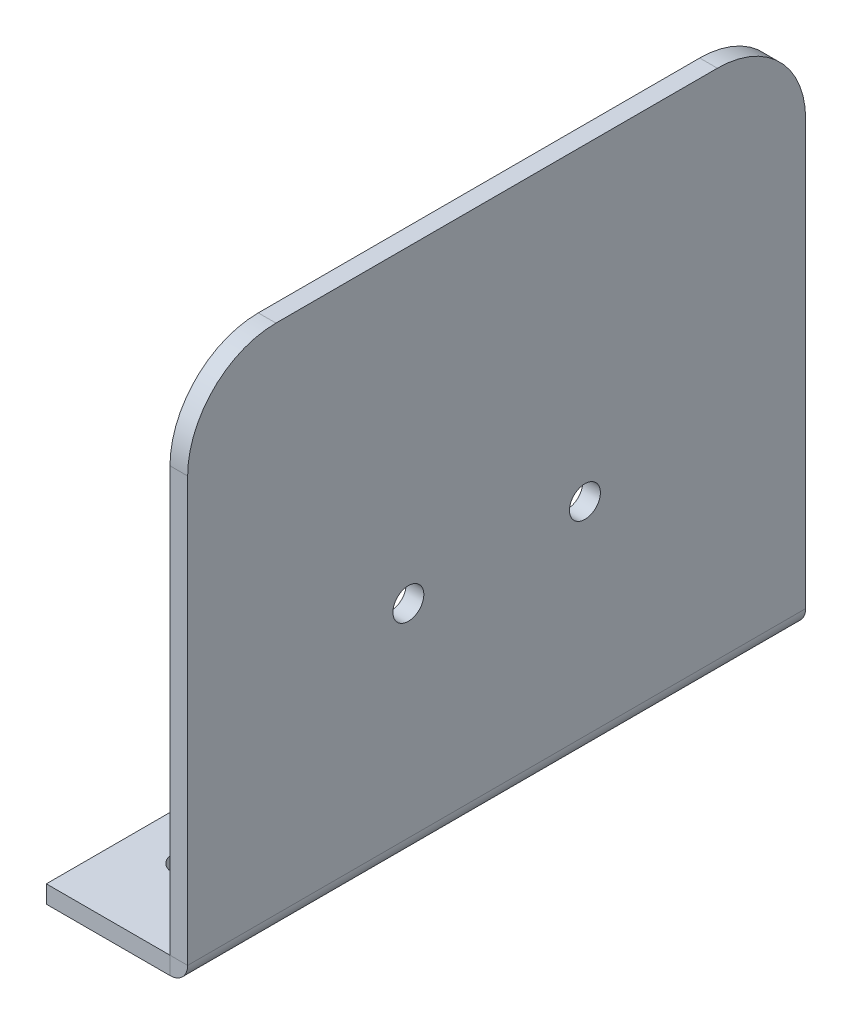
ISO-10303-21;
HEADER;
FILE_DESCRIPTION(('STEP AP214'),'2;1');
FILE_NAME('part.step','',(''),(''),'','','');
FILE_SCHEMA(('AUTOMOTIVE_DESIGN { 1 0 10303 214 1 1 1 1 }'));
ENDSEC;
DATA;
#1=APPLICATION_CONTEXT('core data for automotive mechanical design processes');
#2=APPLICATION_PROTOCOL_DEFINITION('international standard','automotive_design',2000,#1);
#3=PRODUCT_CONTEXT('',#1,'mechanical');
#4=PRODUCT('Part','Part','',(#3));
#5=PRODUCT_RELATED_PRODUCT_CATEGORY('part','',(#4));
#6=PRODUCT_DEFINITION_FORMATION('','',#4);
#7=PRODUCT_DEFINITION_CONTEXT('part definition',#1,'design');
#8=PRODUCT_DEFINITION('design','',#6,#7);
#9=PRODUCT_DEFINITION_SHAPE('','',#8);
#10=(LENGTH_UNIT() NAMED_UNIT(*) SI_UNIT(.MILLI.,.METRE.));
#11=(NAMED_UNIT(*) PLANE_ANGLE_UNIT() SI_UNIT($,.RADIAN.));
#12=(NAMED_UNIT(*) SI_UNIT($,.STERADIAN.) SOLID_ANGLE_UNIT());
#13=UNCERTAINTY_MEASURE_WITH_UNIT(LENGTH_MEASURE(1.E-05),#10,'distance_accuracy_value','');
#14=(GEOMETRIC_REPRESENTATION_CONTEXT(3) GLOBAL_UNCERTAINTY_ASSIGNED_CONTEXT((#13)) GLOBAL_UNIT_ASSIGNED_CONTEXT((#10,
#11,#12)) REPRESENTATION_CONTEXT('',''));
#15=CARTESIAN_POINT('',(0.,0.,0.));
#16=DIRECTION('',(0.,0.,1.));
#17=DIRECTION('',(1.,0.,0.));
#18=AXIS2_PLACEMENT_3D('',#15,#16,#17);
#19=CARTESIAN_POINT('',(14.0049999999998,50.005,-60.));
#20=DIRECTION('',(-1.,0.,0.));
#21=DIRECTION('',(0.,0.,1.));
#22=AXIS2_PLACEMENT_3D('',#19,#20,#21);
#23=PLANE('',#22);
#24=CARTESIAN_POINT('',(14.0049999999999,25.005,-25.));
#25=DIRECTION('',(-1.,0.,0.));
#26=DIRECTION('',(0.,0.,1.));
#27=AXIS2_PLACEMENT_3D('',#24,#25,#26);
#28=CIRCLE('',#27,1.75);
#29=CARTESIAN_POINT('',(14.0049999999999,25.005,-23.25));
#30=VERTEX_POINT('',#29);
#31=EDGE_CURVE('E176',#30,#30,#28,.T.);
#32=ORIENTED_EDGE('',*,*,#31,.F.);
#33=EDGE_LOOP('',(#32));
#34=FACE_BOUND('',#33,.T.);
#35=CARTESIAN_POINT('',(14.0049999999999,25.005,-45.));
#36=DIRECTION('',(-1.,0.,0.));
#37=DIRECTION('',(0.,0.,1.));
#38=AXIS2_PLACEMENT_3D('',#35,#36,#37);
#39=CIRCLE('',#38,1.75);
#40=CARTESIAN_POINT('',(14.0049999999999,25.005,-43.25));
#41=VERTEX_POINT('',#40);
#42=EDGE_CURVE('E182',#41,#41,#39,.T.);
#43=ORIENTED_EDGE('',*,*,#42,.F.);
#44=EDGE_LOOP('',(#43));
#45=FACE_BOUND('',#44,.T.);
#46=DIRECTION('',(0.,-1.,0.));
#47=VECTOR('',#46,1.);
#48=CARTESIAN_POINT('',(14.0050000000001,-15.995,-70.));
#49=LINE('',#48,#47);
#50=CARTESIAN_POINT('',(14.0049999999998,50.0049999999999,-70.));
#51=VERTEX_POINT('',#50);
#52=CARTESIAN_POINT('',(14.005,2.,-70.));
#53=VERTEX_POINT('',#52);
#54=EDGE_CURVE('E40',#51,#53,#49,.T.);
#55=ORIENTED_EDGE('',*,*,#54,.T.);
#56=DIRECTION('',(0.,0.,1.));
#57=VECTOR('',#56,1.);
#58=CARTESIAN_POINT('',(14.005,2.,-60.));
#59=LINE('',#58,#57);
#60=CARTESIAN_POINT('',(14.005,2.,0.));
#61=VERTEX_POINT('',#60);
#62=EDGE_CURVE('E119',#53,#61,#59,.T.);
#63=ORIENTED_EDGE('',*,*,#62,.T.);
#64=DIRECTION('',(0.,1.,0.));
#65=VECTOR('',#64,1.);
#66=CARTESIAN_POINT('',(14.0050000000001,-15.995,0.));
#67=LINE('',#66,#65);
#68=CARTESIAN_POINT('',(14.0049999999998,50.0049999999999,0.));
#69=VERTEX_POINT('',#68);
#70=EDGE_CURVE('E194',#61,#69,#67,.T.);
#71=ORIENTED_EDGE('',*,*,#70,.T.);
#72=CARTESIAN_POINT('',(14.0049999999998,50.005,-10.));
#73=DIRECTION('',(-1.,0.,0.));
#74=DIRECTION('',(0.,0.,-1.));
#75=AXIS2_PLACEMENT_3D('',#72,#73,#74);
#76=CIRCLE('',#75,10.);
#77=CARTESIAN_POINT('',(14.0049999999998,60.005,-10.0000000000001));
#78=VERTEX_POINT('',#77);
#79=EDGE_CURVE('E191',#69,#78,#76,.T.);
#80=ORIENTED_EDGE('',*,*,#79,.T.);
#81=DIRECTION('',(0.,0.,-1.));
#82=VECTOR('',#81,1.);
#83=CARTESIAN_POINT('',(14.0049999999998,60.005,-10.0000000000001));
#84=LINE('',#83,#82);
#85=CARTESIAN_POINT('',(14.0049999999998,60.005,-59.9999999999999));
#86=VERTEX_POINT('',#85);
#87=EDGE_CURVE('E193',#78,#86,#84,.T.);
#88=ORIENTED_EDGE('',*,*,#87,.T.);
#89=CARTESIAN_POINT('',(14.0049999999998,50.005,-60.));
#90=DIRECTION('',(-1.,0.,0.));
#91=DIRECTION('',(0.,0.,1.));
#92=AXIS2_PLACEMENT_3D('',#89,#90,#91);
#93=CIRCLE('',#92,9.99999999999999);
#94=EDGE_CURVE('E196',#86,#51,#93,.T.);
#95=ORIENTED_EDGE('',*,*,#94,.T.);
#96=EDGE_LOOP('',(#55,#63,#71,#80,#88,#95));
#97=FACE_BOUND('',#96,.T.);
#98=ADVANCED_FACE('F36',(#34,#45,#97),#23,.T.);
#99=CARTESIAN_POINT('',(16.0049999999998,50.005,-60.));
#100=DIRECTION('',(-1.,0.,0.));
#101=DIRECTION('',(0.,0.,1.));
#102=AXIS2_PLACEMENT_3D('',#99,#100,#101);
#103=PLANE('',#102);
#104=DIRECTION('',(0.,0.,1.));
#105=VECTOR('',#104,1.);
#106=CARTESIAN_POINT('',(16.005,2.00000000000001,-60.));
#107=LINE('',#106,#105);
#108=CARTESIAN_POINT('',(16.005,2.00000000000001,-70.));
#109=VERTEX_POINT('',#108);
#110=CARTESIAN_POINT('',(16.005,2.00000000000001,0.));
#111=VERTEX_POINT('',#110);
#112=EDGE_CURVE('E45',#109,#111,#107,.T.);
#113=ORIENTED_EDGE('',*,*,#112,.F.);
#114=DIRECTION('',(0.,-1.,0.));
#115=VECTOR('',#114,1.);
#116=CARTESIAN_POINT('',(16.0050000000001,-15.995,-70.));
#117=LINE('',#116,#115);
#118=CARTESIAN_POINT('',(16.0049999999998,50.0049999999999,-70.));
#119=VERTEX_POINT('',#118);
#120=EDGE_CURVE('E61',#119,#109,#117,.T.);
#121=ORIENTED_EDGE('',*,*,#120,.F.);
#122=CARTESIAN_POINT('',(16.0049999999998,50.005,-60.));
#123=DIRECTION('',(-1.,0.,0.));
#124=DIRECTION('',(0.,0.,1.));
#125=AXIS2_PLACEMENT_3D('',#122,#123,#124);
#126=CIRCLE('',#125,9.99999999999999);
#127=CARTESIAN_POINT('',(16.0049999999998,60.005,-59.9999999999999));
#128=VERTEX_POINT('',#127);
#129=EDGE_CURVE('E189',#128,#119,#126,.T.);
#130=ORIENTED_EDGE('',*,*,#129,.F.);
#131=DIRECTION('',(0.,0.,-1.));
#132=VECTOR('',#131,1.);
#133=CARTESIAN_POINT('',(16.0049999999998,60.005,-10.0000000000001));
#134=LINE('',#133,#132);
#135=CARTESIAN_POINT('',(16.0049999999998,60.005,-10.0000000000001));
#136=VERTEX_POINT('',#135);
#137=EDGE_CURVE('E187',#136,#128,#134,.T.);
#138=ORIENTED_EDGE('',*,*,#137,.F.);
#139=CARTESIAN_POINT('',(16.0049999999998,50.005,-10.));
#140=DIRECTION('',(-1.,0.,0.));
#141=DIRECTION('',(0.,0.,-1.));
#142=AXIS2_PLACEMENT_3D('',#139,#140,#141);
#143=CIRCLE('',#142,10.);
#144=CARTESIAN_POINT('',(16.0049999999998,50.0049999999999,0.));
#145=VERTEX_POINT('',#144);
#146=EDGE_CURVE('E185',#145,#136,#143,.T.);
#147=ORIENTED_EDGE('',*,*,#146,.F.);
#148=DIRECTION('',(0.,1.,0.));
#149=VECTOR('',#148,1.);
#150=CARTESIAN_POINT('',(16.0050000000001,-15.995,0.));
#151=LINE('',#150,#149);
#152=EDGE_CURVE('E53',#111,#145,#151,.T.);
#153=ORIENTED_EDGE('',*,*,#152,.F.);
#154=EDGE_LOOP('',(#113,#121,#130,#138,#147,#153));
#155=FACE_BOUND('',#154,.T.);
#156=CARTESIAN_POINT('',(16.0049999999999,25.005,-25.));
#157=DIRECTION('',(-1.,0.,0.));
#158=DIRECTION('',(0.,0.,1.));
#159=AXIS2_PLACEMENT_3D('',#156,#157,#158);
#160=CIRCLE('',#159,1.75);
#161=CARTESIAN_POINT('',(16.0049999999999,25.005,-23.25));
#162=VERTEX_POINT('',#161);
#163=EDGE_CURVE('E173',#162,#162,#160,.T.);
#164=ORIENTED_EDGE('',*,*,#163,.T.);
#165=EDGE_LOOP('',(#164));
#166=FACE_BOUND('',#165,.T.);
#167=CARTESIAN_POINT('',(16.0049999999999,25.005,-45.));
#168=DIRECTION('',(-1.,0.,0.));
#169=DIRECTION('',(0.,0.,1.));
#170=AXIS2_PLACEMENT_3D('',#167,#168,#169);
#171=CIRCLE('',#170,1.75);
#172=CARTESIAN_POINT('',(16.0049999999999,25.005,-43.25));
#173=VERTEX_POINT('',#172);
#174=EDGE_CURVE('E179',#173,#173,#171,.T.);
#175=ORIENTED_EDGE('',*,*,#174,.T.);
#176=EDGE_LOOP('',(#175));
#177=FACE_BOUND('',#176,.T.);
#178=ADVANCED_FACE('F261',(#155,#166,#177),#103,.F.);
#179=CARTESIAN_POINT('',(14.0050000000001,-15.995,0.));
#180=DIRECTION('',(0.,0.,-1.));
#181=DIRECTION('',(0.,-1.,0.));
#182=AXIS2_PLACEMENT_3D('',#179,#180,#181);
#183=PLANE('',#182);
#184=DIRECTION('',(-1.,0.,0.));
#185=VECTOR('',#184,1.);
#186=CARTESIAN_POINT('',(14.005,2.,0.));
#187=LINE('',#186,#185);
#188=EDGE_CURVE('E12',#111,#61,#187,.T.);
#189=ORIENTED_EDGE('',*,*,#188,.F.);
#190=ORIENTED_EDGE('',*,*,#152,.T.);
#191=DIRECTION('',(1.,0.,0.));
#192=VECTOR('',#191,1.);
#193=CARTESIAN_POINT('',(14.0049999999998,50.0049999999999,0.));
#194=LINE('',#193,#192);
#195=EDGE_CURVE('E206',#69,#145,#194,.T.);
#196=ORIENTED_EDGE('',*,*,#195,.F.);
#197=ORIENTED_EDGE('',*,*,#70,.F.);
#198=EDGE_LOOP('',(#189,#190,#196,#197));
#199=FACE_BOUND('',#198,.T.);
#200=ADVANCED_FACE('F38',(#199),#183,.F.);
#201=CARTESIAN_POINT('',(14.0049999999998,50.005,-10.));
#202=DIRECTION('',(1.,0.,0.));
#203=DIRECTION('',(0.,0.,-1.));
#204=AXIS2_PLACEMENT_3D('',#201,#202,#203);
#205=CYLINDRICAL_SURFACE('',#204,10.);
#206=ORIENTED_EDGE('',*,*,#146,.T.);
#207=DIRECTION('',(1.,0.,0.));
#208=VECTOR('',#207,1.);
#209=CARTESIAN_POINT('',(14.0049999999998,60.005,-10.0000000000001));
#210=LINE('',#209,#208);
#211=EDGE_CURVE('E203',#78,#136,#210,.T.);
#212=ORIENTED_EDGE('',*,*,#211,.F.);
#213=ORIENTED_EDGE('',*,*,#79,.F.);
#214=ORIENTED_EDGE('',*,*,#195,.T.);
#215=EDGE_LOOP('',(#206,#212,#213,#214));
#216=FACE_BOUND('',#215,.T.);
#217=ADVANCED_FACE('F221',(#216),#205,.T.);
#218=CARTESIAN_POINT('',(14.0049999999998,60.005,-10.0000000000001));
#219=DIRECTION('',(0.,-1.,0.));
#220=DIRECTION('',(0.,0.,1.));
#221=AXIS2_PLACEMENT_3D('',#218,#219,#220);
#222=PLANE('',#221);
#223=ORIENTED_EDGE('',*,*,#137,.T.);
#224=DIRECTION('',(1.,0.,0.));
#225=VECTOR('',#224,1.);
#226=CARTESIAN_POINT('',(14.0049999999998,60.005,-59.9999999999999));
#227=LINE('',#226,#225);
#228=EDGE_CURVE('E200',#86,#128,#227,.T.);
#229=ORIENTED_EDGE('',*,*,#228,.F.);
#230=ORIENTED_EDGE('',*,*,#87,.F.);
#231=ORIENTED_EDGE('',*,*,#211,.T.);
#232=EDGE_LOOP('',(#223,#229,#230,#231));
#233=FACE_BOUND('',#232,.T.);
#234=ADVANCED_FACE('F226',(#233),#222,.F.);
#235=CARTESIAN_POINT('',(14.0049999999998,50.005,-60.));
#236=DIRECTION('',(1.,0.,0.));
#237=DIRECTION('',(0.,0.,-1.));
#238=AXIS2_PLACEMENT_3D('',#235,#236,#237);
#239=CYLINDRICAL_SURFACE('',#238,9.99999999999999);
#240=ORIENTED_EDGE('',*,*,#129,.T.);
#241=DIRECTION('',(1.,0.,0.));
#242=VECTOR('',#241,1.);
#243=CARTESIAN_POINT('',(14.0049999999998,50.0049999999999,-70.));
#244=LINE('',#243,#242);
#245=EDGE_CURVE('E198',#51,#119,#244,.T.);
#246=ORIENTED_EDGE('',*,*,#245,.F.);
#247=ORIENTED_EDGE('',*,*,#94,.F.);
#248=ORIENTED_EDGE('',*,*,#228,.T.);
#249=EDGE_LOOP('',(#240,#246,#247,#248));
#250=FACE_BOUND('',#249,.T.);
#251=ADVANCED_FACE('F231',(#250),#239,.T.);
#252=CARTESIAN_POINT('',(14.0050000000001,-15.995,-70.));
#253=DIRECTION('',(0.,0.,1.));
#254=DIRECTION('',(0.,1.,0.));
#255=AXIS2_PLACEMENT_3D('',#252,#253,#254);
#256=PLANE('',#255);
#257=DIRECTION('',(1.,0.,0.));
#258=VECTOR('',#257,1.);
#259=CARTESIAN_POINT('',(14.005,2.,-70.));
#260=LINE('',#259,#258);
#261=EDGE_CURVE('E209',#53,#109,#260,.T.);
#262=ORIENTED_EDGE('',*,*,#261,.F.);
#263=ORIENTED_EDGE('',*,*,#54,.F.);
#264=ORIENTED_EDGE('',*,*,#245,.T.);
#265=ORIENTED_EDGE('',*,*,#120,.T.);
#266=EDGE_LOOP('',(#262,#263,#264,#265));
#267=FACE_BOUND('',#266,.T.);
#268=ADVANCED_FACE('F233',(#267),#256,.F.);
#269=CARTESIAN_POINT('',(14.0049999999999,25.005,-45.));
#270=DIRECTION('',(1.,0.,0.));
#271=DIRECTION('',(0.,0.,-1.));
#272=AXIS2_PLACEMENT_3D('',#269,#270,#271);
#273=CYLINDRICAL_SURFACE('',#272,1.75);
#274=ORIENTED_EDGE('',*,*,#42,.T.);
#275=EDGE_LOOP('',(#274));
#276=FACE_BOUND('',#275,.T.);
#277=ORIENTED_EDGE('',*,*,#174,.F.);
#278=EDGE_LOOP('',(#277));
#279=FACE_BOUND('',#278,.T.);
#280=ADVANCED_FACE('F273',(#276,#279),#273,.F.);
#281=CARTESIAN_POINT('',(14.0049999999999,25.005,-25.));
#282=DIRECTION('',(1.,0.,0.));
#283=DIRECTION('',(0.,0.,-1.));
#284=AXIS2_PLACEMENT_3D('',#281,#282,#283);
#285=CYLINDRICAL_SURFACE('',#284,1.75);
#286=ORIENTED_EDGE('',*,*,#31,.T.);
#287=EDGE_LOOP('',(#286));
#288=FACE_BOUND('',#287,.T.);
#289=ORIENTED_EDGE('',*,*,#163,.F.);
#290=EDGE_LOOP('',(#289));
#291=FACE_BOUND('',#290,.T.);
#292=ADVANCED_FACE('F278',(#288,#291),#285,.F.);
#293=CARTESIAN_POINT('',(6.,2.,-9.99999999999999));
#294=DIRECTION('',(0.,-1.,0.));
#295=DIRECTION('',(0.,0.,-1.));
#296=AXIS2_PLACEMENT_3D('',#293,#294,#295);
#297=CYLINDRICAL_SURFACE('',#296,1.75);
#298=CARTESIAN_POINT('',(6.,2.,-9.99999999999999));
#299=DIRECTION('',(0.,1.,0.));
#300=DIRECTION('',(0.,0.,1.));
#301=AXIS2_PLACEMENT_3D('',#298,#299,#300);
#302=CIRCLE('',#301,1.75);
#303=CARTESIAN_POINT('',(6.,2.,-8.24999999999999));
#304=VERTEX_POINT('',#303);
#305=EDGE_CURVE('E168',#304,#304,#302,.T.);
#306=ORIENTED_EDGE('',*,*,#305,.T.);
#307=EDGE_LOOP('',(#306));
#308=FACE_BOUND('',#307,.T.);
#309=CARTESIAN_POINT('',(6.,0.,-9.99999999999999));
#310=DIRECTION('',(0.,1.,0.));
#311=DIRECTION('',(0.,0.,1.));
#312=AXIS2_PLACEMENT_3D('',#309,#310,#311);
#313=CIRCLE('',#312,1.75);
#314=CARTESIAN_POINT('',(6.,0.,-8.24999999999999));
#315=VERTEX_POINT('',#314);
#316=EDGE_CURVE('E145',#315,#315,#313,.T.);
#317=ORIENTED_EDGE('',*,*,#316,.F.);
#318=EDGE_LOOP('',(#317));
#319=FACE_BOUND('',#318,.T.);
#320=ADVANCED_FACE('F257',(#308,#319),#297,.F.);
#321=CARTESIAN_POINT('',(6.,2.,-60.));
#322=DIRECTION('',(0.,-1.,0.));
#323=DIRECTION('',(0.,0.,-1.));
#324=AXIS2_PLACEMENT_3D('',#321,#322,#323);
#325=CYLINDRICAL_SURFACE('',#324,1.75);
#326=CARTESIAN_POINT('',(6.,2.,-60.));
#327=DIRECTION('',(0.,1.,0.));
#328=DIRECTION('',(0.,0.,1.));
#329=AXIS2_PLACEMENT_3D('',#326,#327,#328);
#330=CIRCLE('',#329,1.75);
#331=CARTESIAN_POINT('',(6.,2.,-58.25));
#332=VERTEX_POINT('',#331);
#333=EDGE_CURVE('E165',#332,#332,#330,.T.);
#334=ORIENTED_EDGE('',*,*,#333,.T.);
#335=EDGE_LOOP('',(#334));
#336=FACE_BOUND('',#335,.T.);
#337=CARTESIAN_POINT('',(6.,0.,-60.));
#338=DIRECTION('',(0.,1.,0.));
#339=DIRECTION('',(0.,0.,1.));
#340=AXIS2_PLACEMENT_3D('',#337,#338,#339);
#341=CIRCLE('',#340,1.75);
#342=CARTESIAN_POINT('',(6.,0.,-58.25));
#343=VERTEX_POINT('',#342);
#344=EDGE_CURVE('E142',#343,#343,#341,.T.);
#345=ORIENTED_EDGE('',*,*,#344,.F.);
#346=EDGE_LOOP('',(#345));
#347=FACE_BOUND('',#346,.T.);
#348=ADVANCED_FACE('F250',(#336,#347),#325,.F.);
#349=CARTESIAN_POINT('',(0.,2.,0.));
#350=DIRECTION('',(1.,0.,0.));
#351=DIRECTION('',(0.,0.,-1.));
#352=AXIS2_PLACEMENT_3D('',#349,#350,#351);
#353=PLANE('',#352);
#354=DIRECTION('',(0.,0.,1.));
#355=VECTOR('',#354,1.);
#356=CARTESIAN_POINT('',(0.,0.,0.));
#357=LINE('',#356,#355);
#358=CARTESIAN_POINT('',(0.,0.,-70.));
#359=VERTEX_POINT('',#358);
#360=CARTESIAN_POINT('',(0.,0.,0.));
#361=VERTEX_POINT('',#360);
#362=EDGE_CURVE('E163',#359,#361,#357,.T.);
#363=ORIENTED_EDGE('',*,*,#362,.T.);
#364=DIRECTION('',(0.,-1.,0.));
#365=VECTOR('',#364,1.);
#366=CARTESIAN_POINT('',(0.,2.,0.));
#367=LINE('',#366,#365);
#368=CARTESIAN_POINT('',(0.,2.,0.));
#369=VERTEX_POINT('',#368);
#370=EDGE_CURVE('E128',#369,#361,#367,.T.);
#371=ORIENTED_EDGE('',*,*,#370,.F.);
#372=DIRECTION('',(0.,0.,1.));
#373=VECTOR('',#372,1.);
#374=CARTESIAN_POINT('',(0.,2.,0.));
#375=LINE('',#374,#373);
#376=CARTESIAN_POINT('',(0.,2.,-70.));
#377=VERTEX_POINT('',#376);
#378=EDGE_CURVE('E155',#377,#369,#375,.T.);
#379=ORIENTED_EDGE('',*,*,#378,.F.);
#380=DIRECTION('',(0.,-1.,0.));
#381=VECTOR('',#380,1.);
#382=CARTESIAN_POINT('',(0.,2.,-70.));
#383=LINE('',#382,#381);
#384=EDGE_CURVE('E160',#377,#359,#383,.T.);
#385=ORIENTED_EDGE('',*,*,#384,.T.);
#386=EDGE_LOOP('',(#363,#371,#379,#385));
#387=FACE_BOUND('',#386,.T.);
#388=ADVANCED_FACE('F246',(#387),#353,.F.);
#389=CARTESIAN_POINT('',(66.,2.,-60.));
#390=DIRECTION('',(0.,1.,0.));
#391=DIRECTION('',(0.,0.,1.));
#392=AXIS2_PLACEMENT_3D('',#389,#390,#391);
#393=PLANE('',#392);
#394=ORIENTED_EDGE('',*,*,#62,.F.);
#395=DIRECTION('',(-1.,0.,0.));
#396=VECTOR('',#395,1.);
#397=CARTESIAN_POINT('',(0.,2.,-70.));
#398=LINE('',#397,#396);
#399=EDGE_CURVE('E158',#53,#377,#398,.T.);
#400=ORIENTED_EDGE('',*,*,#399,.T.);
#401=ORIENTED_EDGE('',*,*,#378,.T.);
#402=DIRECTION('',(1.,0.,0.));
#403=VECTOR('',#402,1.);
#404=CARTESIAN_POINT('',(0.,2.,0.));
#405=LINE('',#404,#403);
#406=EDGE_CURVE('E153',#369,#61,#405,.T.);
#407=ORIENTED_EDGE('',*,*,#406,.T.);
#408=EDGE_LOOP('',(#394,#400,#401,#407));
#409=FACE_BOUND('',#408,.T.);
#410=ORIENTED_EDGE('',*,*,#333,.F.);
#411=EDGE_LOOP('',(#410));
#412=FACE_BOUND('',#411,.T.);
#413=ORIENTED_EDGE('',*,*,#305,.F.);
#414=EDGE_LOOP('',(#413));
#415=FACE_BOUND('',#414,.T.);
#416=ADVANCED_FACE('F240',(#409,#412,#415),#393,.T.);
#417=CARTESIAN_POINT('',(0.,2.,-70.));
#418=DIRECTION('',(0.,0.,1.));
#419=DIRECTION('',(1.,0.,0.));
#420=AXIS2_PLACEMENT_3D('',#417,#418,#419);
#421=PLANE('',#420);
#422=ORIENTED_EDGE('',*,*,#399,.F.);
#423=DIRECTION('',(0.,-1.,0.));
#424=VECTOR('',#423,1.);
#425=CARTESIAN_POINT('',(14.005,2.,-70.));
#426=LINE('',#425,#424);
#427=CARTESIAN_POINT('',(14.005,0.,-70.));
#428=VERTEX_POINT('',#427);
#429=EDGE_CURVE('E151',#53,#428,#426,.T.);
#430=ORIENTED_EDGE('',*,*,#429,.T.);
#431=DIRECTION('',(-1.,0.,0.));
#432=VECTOR('',#431,1.);
#433=CARTESIAN_POINT('',(0.,0.,-70.));
#434=LINE('',#433,#432);
#435=EDGE_CURVE('E140',#428,#359,#434,.T.);
#436=ORIENTED_EDGE('',*,*,#435,.T.);
#437=ORIENTED_EDGE('',*,*,#384,.F.);
#438=EDGE_LOOP('',(#422,#430,#436,#437));
#439=FACE_BOUND('',#438,.T.);
#440=ADVANCED_FACE('F243',(#439),#421,.F.);
#441=CARTESIAN_POINT('',(66.,0.,-60.));
#442=DIRECTION('',(0.,1.,0.));
#443=DIRECTION('',(0.,0.,1.));
#444=AXIS2_PLACEMENT_3D('',#441,#442,#443);
#445=PLANE('',#444);
#446=ORIENTED_EDGE('',*,*,#316,.T.);
#447=EDGE_LOOP('',(#446));
#448=FACE_BOUND('',#447,.T.);
#449=ORIENTED_EDGE('',*,*,#344,.T.);
#450=EDGE_LOOP('',(#449));
#451=FACE_BOUND('',#450,.T.);
#452=ORIENTED_EDGE('',*,*,#435,.F.);
#453=DIRECTION('',(0.,0.,1.));
#454=VECTOR('',#453,1.);
#455=CARTESIAN_POINT('',(14.005,0.,-60.));
#456=LINE('',#455,#454);
#457=CARTESIAN_POINT('',(14.005,0.,0.));
#458=VERTEX_POINT('',#457);
#459=EDGE_CURVE('E116',#428,#458,#456,.T.);
#460=ORIENTED_EDGE('',*,*,#459,.T.);
#461=DIRECTION('',(1.,0.,0.));
#462=VECTOR('',#461,1.);
#463=CARTESIAN_POINT('',(0.,0.,0.));
#464=LINE('',#463,#462);
#465=EDGE_CURVE('E129',#361,#458,#464,.T.);
#466=ORIENTED_EDGE('',*,*,#465,.F.);
#467=ORIENTED_EDGE('',*,*,#362,.F.);
#468=EDGE_LOOP('',(#452,#460,#466,#467));
#469=FACE_BOUND('',#468,.T.);
#470=ADVANCED_FACE('F139',(#448,#451,#469),#445,.F.);
#471=CARTESIAN_POINT('',(0.,2.,0.));
#472=DIRECTION('',(0.,0.,-1.));
#473=DIRECTION('',(-1.,0.,0.));
#474=AXIS2_PLACEMENT_3D('',#471,#472,#473);
#475=PLANE('',#474);
#476=ORIENTED_EDGE('',*,*,#465,.T.);
#477=DIRECTION('',(0.,1.,0.));
#478=VECTOR('',#477,1.);
#479=CARTESIAN_POINT('',(14.005,2.,0.));
#480=LINE('',#479,#478);
#481=EDGE_CURVE('E123',#458,#61,#480,.T.);
#482=ORIENTED_EDGE('',*,*,#481,.T.);
#483=ORIENTED_EDGE('',*,*,#406,.F.);
#484=ORIENTED_EDGE('',*,*,#370,.T.);
#485=EDGE_LOOP('',(#476,#482,#483,#484));
#486=FACE_BOUND('',#485,.T.);
#487=ADVANCED_FACE('F132',(#486),#475,.F.);
#488=CARTESIAN_POINT('',(14.005,2.,0.));
#489=DIRECTION('',(0.,0.,1.));
#490=DIRECTION('',(1.,0.,0.));
#491=AXIS2_PLACEMENT_3D('',#488,#489,#490);
#492=PLANE('',#491);
#493=CARTESIAN_POINT('',(14.005,2.,0.));
#494=DIRECTION('',(0.,0.,-1.));
#495=DIRECTION('',(-1.,0.,0.));
#496=AXIS2_PLACEMENT_3D('',#493,#494,#495);
#497=CIRCLE('',#496,2.);
#498=EDGE_CURVE('E111',#111,#458,#497,.T.);
#499=ORIENTED_EDGE('',*,*,#498,.F.);
#500=ORIENTED_EDGE('',*,*,#188,.T.);
#501=ORIENTED_EDGE('',*,*,#481,.F.);
#502=EDGE_LOOP('',(#499,#500,#501));
#503=FACE_BOUND('',#502,.T.);
#504=ADVANCED_FACE('F125',(#503),#492,.T.);
#505=CARTESIAN_POINT('',(14.005,2.,-70.));
#506=DIRECTION('',(0.,0.,-1.));
#507=DIRECTION('',(-1.,0.,0.));
#508=AXIS2_PLACEMENT_3D('',#505,#506,#507);
#509=CYLINDRICAL_SURFACE('',#508,2.);
#510=CARTESIAN_POINT('',(14.005,2.,-70.));
#511=DIRECTION('',(0.,0.,-1.));
#512=DIRECTION('',(-1.,0.,0.));
#513=AXIS2_PLACEMENT_3D('',#510,#511,#512);
#514=CIRCLE('',#513,2.);
#515=EDGE_CURVE('E120',#109,#428,#514,.T.);
#516=ORIENTED_EDGE('',*,*,#515,.F.);
#517=ORIENTED_EDGE('',*,*,#112,.T.);
#518=ORIENTED_EDGE('',*,*,#498,.T.);
#519=ORIENTED_EDGE('',*,*,#459,.F.);
#520=EDGE_LOOP('',(#516,#517,#518,#519));
#521=FACE_BOUND('',#520,.T.);
#522=ADVANCED_FACE('F114',(#521),#509,.T.);
#523=CARTESIAN_POINT('',(14.005,2.,-70.));
#524=DIRECTION('',(0.,0.,-1.));
#525=DIRECTION('',(-1.,0.,0.));
#526=AXIS2_PLACEMENT_3D('',#523,#524,#525);
#527=PLANE('',#526);
#528=ORIENTED_EDGE('',*,*,#261,.T.);
#529=ORIENTED_EDGE('',*,*,#515,.T.);
#530=ORIENTED_EDGE('',*,*,#429,.F.);
#531=EDGE_LOOP('',(#528,#529,#530));
#532=FACE_BOUND('',#531,.T.);
#533=ADVANCED_FACE('F236',(#532),#527,.T.);
#534=CLOSED_SHELL('',(#98,#178,#200,#217,#234,#251,#268,#280,#292,#320,#348,#388,#416,#440,#470,
#487,#504,#522,#533));
#535=MANIFOLD_SOLID_BREP('B2',#534);
#536=ADVANCED_BREP_SHAPE_REPRESENTATION('',(#18,#535),#14);
#537=SHAPE_DEFINITION_REPRESENTATION(#9,#536);
ENDSEC;
END-ISO-10303-21;
